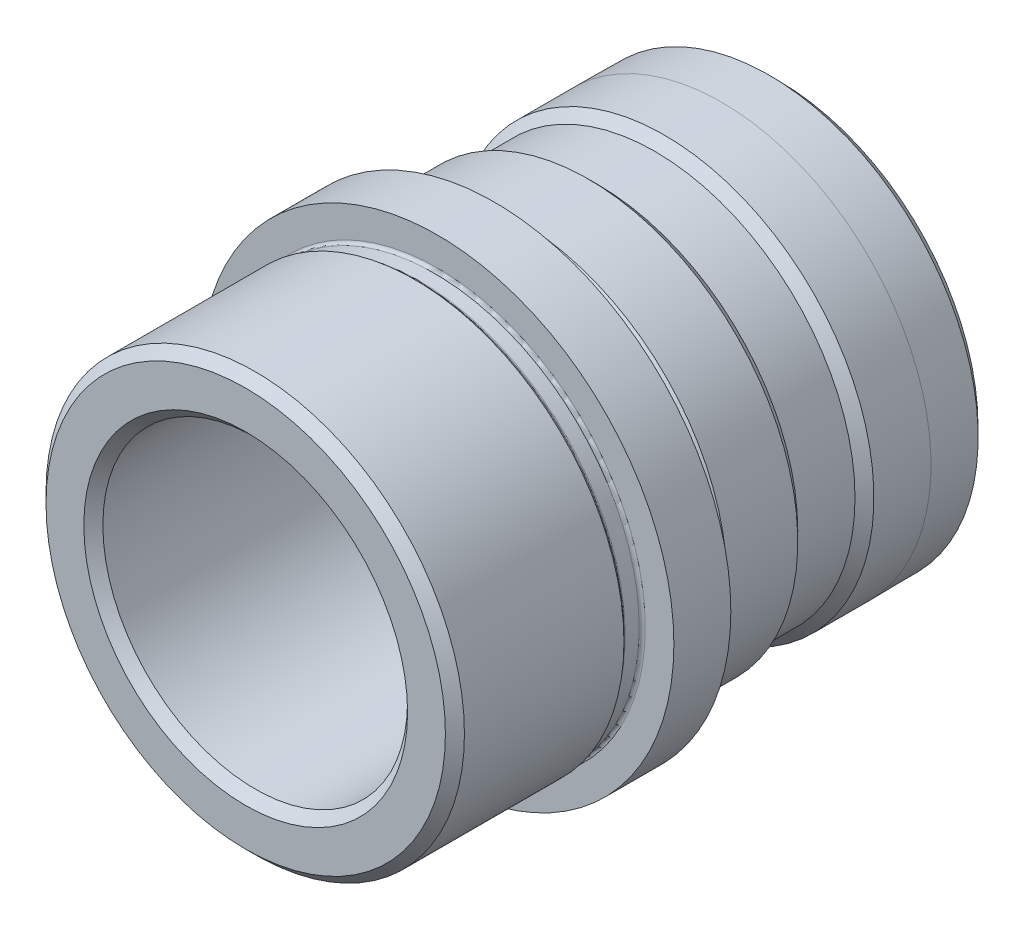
ISO-10303-21;
HEADER;
FILE_DESCRIPTION(('STEP AP214'),'2;1');
FILE_NAME('part.step','',(''),(''),'','','');
FILE_SCHEMA(('AUTOMOTIVE_DESIGN { 1 0 10303 214 1 1 1 1 }'));
ENDSEC;
DATA;
#1=APPLICATION_CONTEXT('core data for automotive mechanical design processes');
#2=APPLICATION_PROTOCOL_DEFINITION('international standard','automotive_design',2000,#1);
#3=PRODUCT_CONTEXT('',#1,'mechanical');
#4=PRODUCT('Part','Part','',(#3));
#5=PRODUCT_RELATED_PRODUCT_CATEGORY('part','',(#4));
#6=PRODUCT_DEFINITION_FORMATION('','',#4);
#7=PRODUCT_DEFINITION_CONTEXT('part definition',#1,'design');
#8=PRODUCT_DEFINITION('design','',#6,#7);
#9=PRODUCT_DEFINITION_SHAPE('','',#8);
#10=(LENGTH_UNIT() NAMED_UNIT(*) SI_UNIT(.MILLI.,.METRE.));
#11=(NAMED_UNIT(*) PLANE_ANGLE_UNIT() SI_UNIT($,.RADIAN.));
#12=(NAMED_UNIT(*) SI_UNIT($,.STERADIAN.) SOLID_ANGLE_UNIT());
#13=UNCERTAINTY_MEASURE_WITH_UNIT(LENGTH_MEASURE(1.E-05),#10,'distance_accuracy_value','');
#14=(GEOMETRIC_REPRESENTATION_CONTEXT(3) GLOBAL_UNCERTAINTY_ASSIGNED_CONTEXT((#13)) GLOBAL_UNIT_ASSIGNED_CONTEXT((#10,
#11,#12)) REPRESENTATION_CONTEXT('',''));
#15=CARTESIAN_POINT('',(0.,0.,0.));
#16=DIRECTION('',(0.,0.,1.));
#17=DIRECTION('',(1.,0.,0.));
#18=AXIS2_PLACEMENT_3D('',#15,#16,#17);
#19=CARTESIAN_POINT('',(0.,12.70762,16.002));
#20=DIRECTION('',(0.,0.,1.));
#21=DIRECTION('',(1.,0.,0.));
#22=AXIS2_PLACEMENT_3D('',#19,#20,#21);
#23=PLANE('',#22);
#24=CARTESIAN_POINT('',(0.,0.,16.002));
#25=DIRECTION('',(0.,0.,1.));
#26=DIRECTION('',(1.,0.,0.));
#27=AXIS2_PLACEMENT_3D('',#24,#25,#26);
#28=CIRCLE('',#27,16.65605);
#29=CARTESIAN_POINT('',(16.65605,0.,16.002));
#30=VERTEX_POINT('',#29);
#31=EDGE_CURVE('E66',#30,#30,#28,.T.);
#32=ORIENTED_EDGE('',*,*,#31,.T.);
#33=EDGE_LOOP('',(#32));
#34=FACE_BOUND('',#33,.T.);
#35=CARTESIAN_POINT('',(0.,0.,16.002));
#36=DIRECTION('',(0.,0.,1.));
#37=DIRECTION('',(1.,0.,0.));
#38=AXIS2_PLACEMENT_3D('',#35,#36,#37);
#39=CIRCLE('',#38,13.50137);
#40=CARTESIAN_POINT('',(13.50137,0.,16.002));
#41=VERTEX_POINT('',#40);
#42=EDGE_CURVE('E69',#41,#41,#39,.F.);
#43=ORIENTED_EDGE('',*,*,#42,.T.);
#44=EDGE_LOOP('',(#43));
#45=FACE_BOUND('',#44,.T.);
#46=ADVANCED_FACE('F31',(#34,#45),#23,.T.);
#47=CARTESIAN_POINT('',(0.,0.,0.));
#48=DIRECTION('',(0.,0.,-1.));
#49=DIRECTION('',(-1.,0.,0.));
#50=AXIS2_PLACEMENT_3D('',#47,#48,#49);
#51=CYLINDRICAL_SURFACE('',#50,17.4498);
#52=CARTESIAN_POINT('',(0.,0.,15.20825));
#53=DIRECTION('',(0.,0.,1.));
#54=DIRECTION('',(1.,0.,0.));
#55=AXIS2_PLACEMENT_3D('',#52,#53,#54);
#56=CIRCLE('',#55,17.4498);
#57=CARTESIAN_POINT('',(17.4498,0.,15.20825));
#58=VERTEX_POINT('',#57);
#59=EDGE_CURVE('E72',#58,#58,#56,.F.);
#60=ORIENTED_EDGE('',*,*,#59,.T.);
#61=EDGE_LOOP('',(#60));
#62=FACE_BOUND('',#61,.T.);
#63=CARTESIAN_POINT('',(0.,0.,1.905));
#64=DIRECTION('',(0.,0.,-1.));
#65=DIRECTION('',(-1.,0.,0.));
#66=AXIS2_PLACEMENT_3D('',#63,#64,#65);
#67=CIRCLE('',#66,17.4498);
#68=CARTESIAN_POINT('',(-17.4498,0.,1.905));
#69=VERTEX_POINT('',#68);
#70=EDGE_CURVE('E87',#69,#69,#67,.T.);
#71=ORIENTED_EDGE('',*,*,#70,.F.);
#72=EDGE_LOOP('',(#71));
#73=FACE_BOUND('',#72,.T.);
#74=ADVANCED_FACE('F156',(#62,#73),#51,.T.);
#75=CARTESIAN_POINT('',(0.,0.,1.524));
#76=DIRECTION('',(0.,0.,1.));
#77=DIRECTION('',(1.,0.,0.));
#78=AXIS2_PLACEMENT_3D('',#75,#76,#77);
#79=CONICAL_SURFACE('',#78,17.0688,0.785398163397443);
#80=CARTESIAN_POINT('',(0.,0.,1.59839487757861));
#81=DIRECTION('',(0.,0.,1.));
#82=DIRECTION('',(1.,0.,0.));
#83=AXIS2_PLACEMENT_3D('',#80,#81,#82);
#84=CIRCLE('',#83,17.1431948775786);
#85=CARTESIAN_POINT('',(17.1431948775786,0.,1.59839487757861));
#86=VERTEX_POINT('',#85);
#87=EDGE_CURVE('E38',#86,#86,#84,.T.);
#88=ORIENTED_EDGE('',*,*,#87,.T.);
#89=EDGE_LOOP('',(#88));
#90=FACE_BOUND('',#89,.T.);
#91=ORIENTED_EDGE('',*,*,#70,.T.);
#92=EDGE_LOOP('',(#91));
#93=FACE_BOUND('',#92,.T.);
#94=ADVANCED_FACE('F152',(#90,#93),#79,.T.);
#95=CARTESIAN_POINT('',(0.,0.,0.));
#96=DIRECTION('',(0.,0.,-1.));
#97=DIRECTION('',(-1.,0.,0.));
#98=AXIS2_PLACEMENT_3D('',#95,#96,#97);
#99=CYLINDRICAL_SURFACE('',#98,17.0688);
#100=CARTESIAN_POINT('',(0.,0.,1.41878975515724));
#101=DIRECTION('',(0.,0.,-1.));
#102=DIRECTION('',(-1.,0.,0.));
#103=AXIS2_PLACEMENT_3D('',#100,#101,#102);
#104=CIRCLE('',#103,17.0688);
#105=CARTESIAN_POINT('',(-17.0688,0.,1.41878975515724));
#106=VERTEX_POINT('',#105);
#107=EDGE_CURVE('E42',#106,#106,#104,.T.);
#108=ORIENTED_EDGE('',*,*,#107,.T.);
#109=EDGE_LOOP('',(#108));
#110=FACE_BOUND('',#109,.T.);
#111=CARTESIAN_POINT('',(0.,0.,0.254));
#112=DIRECTION('',(0.,0.,1.));
#113=DIRECTION('',(1.,0.,0.));
#114=AXIS2_PLACEMENT_3D('',#111,#112,#113);
#115=CIRCLE('',#114,17.0688);
#116=CARTESIAN_POINT('',(17.0688,0.,0.254));
#117=VERTEX_POINT('',#116);
#118=EDGE_CURVE('E46',#117,#117,#115,.T.);
#119=ORIENTED_EDGE('',*,*,#118,.T.);
#120=EDGE_LOOP('',(#119));
#121=FACE_BOUND('',#120,.T.);
#122=ADVANCED_FACE('F149',(#110,#121),#99,.T.);
#123=CARTESIAN_POINT('',(0.,19.7104,0.));
#124=DIRECTION('',(0.,0.,1.));
#125=DIRECTION('',(1.,0.,0.));
#126=AXIS2_PLACEMENT_3D('',#123,#124,#125);
#127=PLANE('',#126);
#128=CARTESIAN_POINT('',(0.,0.,0.));
#129=DIRECTION('',(0.,0.,1.));
#130=DIRECTION('',(1.,0.,0.));
#131=AXIS2_PLACEMENT_3D('',#128,#129,#130);
#132=CIRCLE('',#131,17.3228);
#133=CARTESIAN_POINT('',(17.3228,0.,0.));
#134=VERTEX_POINT('',#133);
#135=EDGE_CURVE('E10',#134,#134,#132,.F.);
#136=ORIENTED_EDGE('',*,*,#135,.T.);
#137=EDGE_LOOP('',(#136));
#138=FACE_BOUND('',#137,.T.);
#139=CARTESIAN_POINT('',(0.,0.,0.));
#140=DIRECTION('',(0.,0.,-1.));
#141=DIRECTION('',(-1.,0.,0.));
#142=AXIS2_PLACEMENT_3D('',#139,#140,#141);
#143=CIRCLE('',#142,19.7104);
#144=CARTESIAN_POINT('',(-19.7104,0.,0.));
#145=VERTEX_POINT('',#144);
#146=EDGE_CURVE('E386',#145,#145,#143,.T.);
#147=ORIENTED_EDGE('',*,*,#146,.F.);
#148=EDGE_LOOP('',(#147));
#149=FACE_BOUND('',#148,.T.);
#150=ADVANCED_FACE('F145',(#138,#149),#127,.T.);
#151=CARTESIAN_POINT('',(0.,0.,0.));
#152=DIRECTION('',(0.,0.,-1.));
#153=DIRECTION('',(-1.,0.,0.));
#154=AXIS2_PLACEMENT_3D('',#151,#152,#153);
#155=CYLINDRICAL_SURFACE('',#154,19.7104);
#156=ORIENTED_EDGE('',*,*,#146,.T.);
#157=EDGE_LOOP('',(#156));
#158=FACE_BOUND('',#157,.T.);
#159=CARTESIAN_POINT('',(0.,0.,-4.7498));
#160=DIRECTION('',(0.,0.,-1.));
#161=DIRECTION('',(-1.,0.,0.));
#162=AXIS2_PLACEMENT_3D('',#159,#160,#161);
#163=CIRCLE('',#162,19.7104);
#164=CARTESIAN_POINT('',(-19.7104,0.,-4.7498));
#165=VERTEX_POINT('',#164);
#166=EDGE_CURVE('E384',#165,#165,#163,.T.);
#167=ORIENTED_EDGE('',*,*,#166,.F.);
#168=EDGE_LOOP('',(#167));
#169=FACE_BOUND('',#168,.T.);
#170=ADVANCED_FACE('F141',(#158,#169),#155,.T.);
#171=CARTESIAN_POINT('',(0.,19.7104,-4.7498));
#172=DIRECTION('',(0.,0.,-1.));
#173=DIRECTION('',(-1.,0.,0.));
#174=AXIS2_PLACEMENT_3D('',#171,#172,#173);
#175=PLANE('',#174);
#176=CARTESIAN_POINT('',(0.,0.,-4.7498));
#177=DIRECTION('',(0.,0.,-1.));
#178=DIRECTION('',(-1.,0.,0.));
#179=AXIS2_PLACEMENT_3D('',#176,#177,#178);
#180=CIRCLE('',#179,17.3228);
#181=CARTESIAN_POINT('',(-17.3228,0.,-4.7498));
#182=VERTEX_POINT('',#181);
#183=EDGE_CURVE('E51',#182,#182,#180,.F.);
#184=ORIENTED_EDGE('',*,*,#183,.T.);
#185=EDGE_LOOP('',(#184));
#186=FACE_BOUND('',#185,.T.);
#187=ORIENTED_EDGE('',*,*,#166,.T.);
#188=EDGE_LOOP('',(#187));
#189=FACE_BOUND('',#188,.T.);
#190=ADVANCED_FACE('F137',(#186,#189),#175,.T.);
#191=CARTESIAN_POINT('',(0.,0.,0.));
#192=DIRECTION('',(0.,0.,-1.));
#193=DIRECTION('',(-1.,0.,0.));
#194=AXIS2_PLACEMENT_3D('',#191,#192,#193);
#195=CYLINDRICAL_SURFACE('',#194,17.0688);
#196=CARTESIAN_POINT('',(0.,0.,-6.16858975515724));
#197=DIRECTION('',(0.,0.,-1.));
#198=DIRECTION('',(-1.,0.,0.));
#199=AXIS2_PLACEMENT_3D('',#196,#197,#198);
#200=CIRCLE('',#199,17.0688);
#201=CARTESIAN_POINT('',(-17.0688,0.,-6.16858975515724));
#202=VERTEX_POINT('',#201);
#203=EDGE_CURVE('E54',#202,#202,#200,.F.);
#204=ORIENTED_EDGE('',*,*,#203,.T.);
#205=EDGE_LOOP('',(#204));
#206=FACE_BOUND('',#205,.T.);
#207=CARTESIAN_POINT('',(0.,0.,-5.0038));
#208=DIRECTION('',(0.,0.,-1.));
#209=DIRECTION('',(-1.,0.,0.));
#210=AXIS2_PLACEMENT_3D('',#207,#208,#209);
#211=CIRCLE('',#210,17.0688);
#212=CARTESIAN_POINT('',(-17.0688,0.,-5.0038));
#213=VERTEX_POINT('',#212);
#214=EDGE_CURVE('E57',#213,#213,#211,.T.);
#215=ORIENTED_EDGE('',*,*,#214,.T.);
#216=EDGE_LOOP('',(#215));
#217=FACE_BOUND('',#216,.T.);
#218=ADVANCED_FACE('F133',(#206,#217),#195,.T.);
#219=CARTESIAN_POINT('',(0.,0.,-6.67385));
#220=DIRECTION('',(0.,0.,-1.));
#221=DIRECTION('',(-1.,0.,0.));
#222=AXIS2_PLACEMENT_3D('',#219,#220,#221);
#223=CONICAL_SURFACE('',#222,17.46885,0.78539816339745);
#224=CARTESIAN_POINT('',(0.,0.,-6.34819487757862));
#225=DIRECTION('',(0.,0.,-1.));
#226=DIRECTION('',(-1.,0.,0.));
#227=AXIS2_PLACEMENT_3D('',#224,#225,#226);
#228=CIRCLE('',#227,17.1431948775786);
#229=CARTESIAN_POINT('',(-17.1431948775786,0.,-6.34819487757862));
#230=VERTEX_POINT('',#229);
#231=EDGE_CURVE('E60',#230,#230,#228,.T.);
#232=ORIENTED_EDGE('',*,*,#231,.T.);
#233=EDGE_LOOP('',(#232));
#234=FACE_BOUND('',#233,.T.);
#235=CARTESIAN_POINT('',(0.,0.,-6.67385));
#236=DIRECTION('',(0.,0.,-1.));
#237=DIRECTION('',(-1.,0.,0.));
#238=AXIS2_PLACEMENT_3D('',#235,#236,#237);
#239=CIRCLE('',#238,17.46885);
#240=CARTESIAN_POINT('',(-17.46885,0.,-6.67385));
#241=VERTEX_POINT('',#240);
#242=EDGE_CURVE('E381',#241,#241,#239,.T.);
#243=ORIENTED_EDGE('',*,*,#242,.F.);
#244=EDGE_LOOP('',(#243));
#245=FACE_BOUND('',#244,.T.);
#246=ADVANCED_FACE('F129',(#234,#245),#223,.T.);
#247=CARTESIAN_POINT('',(0.,0.,0.));
#248=DIRECTION('',(0.,0.,-1.));
#249=DIRECTION('',(-1.,0.,0.));
#250=AXIS2_PLACEMENT_3D('',#247,#248,#249);
#251=CYLINDRICAL_SURFACE('',#250,17.46885);
#252=ORIENTED_EDGE('',*,*,#242,.T.);
#253=EDGE_LOOP('',(#252));
#254=FACE_BOUND('',#253,.T.);
#255=CARTESIAN_POINT('',(0.,0.,-12.573));
#256=DIRECTION('',(0.,0.,-1.));
#257=DIRECTION('',(-1.,0.,0.));
#258=AXIS2_PLACEMENT_3D('',#255,#256,#257);
#259=CIRCLE('',#258,17.46885);
#260=CARTESIAN_POINT('',(-17.46885,0.,-12.573));
#261=VERTEX_POINT('',#260);
#262=EDGE_CURVE('E378',#261,#261,#259,.T.);
#263=ORIENTED_EDGE('',*,*,#262,.F.);
#264=EDGE_LOOP('',(#263));
#265=FACE_BOUND('',#264,.T.);
#266=ADVANCED_FACE('F125',(#254,#265),#251,.T.);
#267=CARTESIAN_POINT('',(0.,0.,-13.3604));
#268=DIRECTION('',(0.,0.,1.));
#269=DIRECTION('',(1.,0.,0.));
#270=AXIS2_PLACEMENT_3D('',#267,#268,#269);
#271=CONICAL_SURFACE('',#270,16.68145,0.785398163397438);
#272=ORIENTED_EDGE('',*,*,#262,.T.);
#273=EDGE_LOOP('',(#272));
#274=FACE_BOUND('',#273,.T.);
#275=CARTESIAN_POINT('',(0.,0.,-13.3604));
#276=DIRECTION('',(0.,0.,-1.));
#277=DIRECTION('',(-1.,0.,0.));
#278=AXIS2_PLACEMENT_3D('',#275,#276,#277);
#279=CIRCLE('',#278,16.68145);
#280=CARTESIAN_POINT('',(-16.68145,0.,-13.3604));
#281=VERTEX_POINT('',#280);
#282=EDGE_CURVE('E372',#281,#281,#279,.T.);
#283=ORIENTED_EDGE('',*,*,#282,.F.);
#284=EDGE_LOOP('',(#283));
#285=FACE_BOUND('',#284,.T.);
#286=ADVANCED_FACE('F120',(#274,#285),#271,.T.);
#287=CARTESIAN_POINT('',(0.,0.,0.));
#288=DIRECTION('',(0.,0.,-1.));
#289=DIRECTION('',(-1.,0.,0.));
#290=AXIS2_PLACEMENT_3D('',#287,#288,#289);
#291=CYLINDRICAL_SURFACE('',#290,16.68145);
#292=CARTESIAN_POINT('',(0.,-16.68145,-13.3731));
#293=CARTESIAN_POINT('',(-0.132679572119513,-16.6814479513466,-13.3731055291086));
#294=CARTESIAN_POINT('',(-0.265438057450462,-16.6798504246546,-13.3842562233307));
#295=CARTESIAN_POINT('',(-0.527249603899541,-16.6736312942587,-13.4285561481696));
#296=CARTESIAN_POINT('',(-0.656298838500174,-16.6690066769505,-13.4617273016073));
#297=CARTESIAN_POINT('',(-0.906864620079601,-16.6572534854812,-13.5490614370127));
#298=CARTESIAN_POINT('',(-1.02838658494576,-16.650126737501,-13.6032091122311));
#299=CARTESIAN_POINT('',(-1.26059924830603,-16.6341584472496,-13.7309230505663));
#300=CARTESIAN_POINT('',(-1.37129156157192,-16.6253171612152,-13.8044864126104));
#301=CARTESIAN_POINT('',(-1.57950500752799,-16.6068343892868,-13.9694979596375));
#302=CARTESIAN_POINT('',(-1.67693853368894,-16.5971882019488,-14.061056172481));
#303=CARTESIAN_POINT('',(-1.8551131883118,-16.5782199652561,-14.2592217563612));
#304=CARTESIAN_POINT('',(-1.93585339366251,-16.5688979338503,-14.3658299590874));
#305=CARTESIAN_POINT('',(-2.0786859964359,-16.551587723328,-14.5916519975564));
#306=CARTESIAN_POINT('',(-2.14069446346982,-16.5436056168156,-14.7109194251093));
#307=CARTESIAN_POINT('',(-2.24376716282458,-16.529942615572,-14.9583084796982));
#308=CARTESIAN_POINT('',(-2.28483242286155,-16.5242616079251,-15.0864296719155));
#309=CARTESIAN_POINT('',(-2.34458273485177,-16.5158898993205,-15.3469715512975));
#310=CARTESIAN_POINT('',(-2.36341716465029,-16.5131792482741,-15.4793573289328));
#311=CARTESIAN_POINT('',(-2.37863376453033,-16.5109944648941,-15.7454360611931));
#312=CARTESIAN_POINT('',(-2.37501709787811,-16.5115201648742,-15.8791289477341));
#313=CARTESIAN_POINT('',(-2.34555641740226,-16.5157304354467,-16.1429762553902));
#314=CARTESIAN_POINT('',(-2.31987817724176,-16.5193914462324,-16.2731496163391));
#315=CARTESIAN_POINT('',(-2.24728248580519,-16.5294230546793,-16.527320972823));
#316=CARTESIAN_POINT('',(-2.20036448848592,-16.5357937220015,-16.6513188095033));
#317=CARTESIAN_POINT('',(-2.08644683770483,-16.550553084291,-16.890127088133));
#318=CARTESIAN_POINT('',(-2.01937637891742,-16.558948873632,-17.0049032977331));
#319=CARTESIAN_POINT('',(-1.86710818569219,-16.576807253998,-17.2216347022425));
#320=CARTESIAN_POINT('',(-1.78190937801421,-16.5862699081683,-17.3235891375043));
#321=CARTESIAN_POINT('',(-1.59489016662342,-16.6053001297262,-17.5127441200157));
#322=CARTESIAN_POINT('',(-1.49292711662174,-16.6148678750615,-17.5998036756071));
#323=CARTESIAN_POINT('',(-1.27576155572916,-16.6329509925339,-17.7555956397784));
#324=CARTESIAN_POINT('',(-1.16055899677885,-16.6414663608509,-17.8243279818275));
#325=CARTESIAN_POINT('',(-0.920066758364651,-16.6564929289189,-17.9415193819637));
#326=CARTESIAN_POINT('',(-0.794772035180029,-16.6630031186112,-17.9899682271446));
#327=CARTESIAN_POINT('',(-0.537711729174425,-16.6732771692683,-18.0650982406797));
#328=CARTESIAN_POINT('',(-0.405946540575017,-16.6770411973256,-18.0917807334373));
#329=CARTESIAN_POINT('',(-0.140903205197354,-16.6813768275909,-18.1224346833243));
#330=CARTESIAN_POINT('',(-0.00764792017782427,-16.6819756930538,-18.1266000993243));
#331=CARTESIAN_POINT('',(0.257659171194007,-16.6799875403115,-18.1126155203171));
#332=CARTESIAN_POINT('',(0.389711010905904,-16.6774006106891,-18.0944661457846));
#333=CARTESIAN_POINT('',(0.648280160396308,-16.6693484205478,-18.0365284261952));
#334=CARTESIAN_POINT('',(0.774818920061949,-16.6638956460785,-17.9968339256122));
#335=CARTESIAN_POINT('',(1.01944471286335,-16.650721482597,-17.8970312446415));
#336=CARTESIAN_POINT('',(1.137531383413,-16.6429999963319,-17.8369221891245));
#337=CARTESIAN_POINT('',(1.36275818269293,-16.626079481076,-17.6975370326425));
#338=CARTESIAN_POINT('',(1.46982096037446,-16.6168710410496,-17.6181371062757));
#339=CARTESIAN_POINT('',(1.66917062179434,-16.5980326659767,-17.442597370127));
#340=CARTESIAN_POINT('',(1.76145673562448,-16.5884027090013,-17.3464566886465));
#341=CARTESIAN_POINT('',(1.92933348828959,-16.569720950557,-17.1393039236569));
#342=CARTESIAN_POINT('',(2.00479456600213,-16.5606739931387,-17.028186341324));
#343=CARTESIAN_POINT('',(2.13598041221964,-16.5442664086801,-16.7947392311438));
#344=CARTESIAN_POINT('',(2.19170567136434,-16.5369057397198,-16.6724099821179));
#345=CARTESIAN_POINT('',(2.28163431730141,-16.5247385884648,-16.4204085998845));
#346=CARTESIAN_POINT('',(2.31590745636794,-16.5199238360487,-16.2907617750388));
#347=CARTESIAN_POINT('',(2.36218189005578,-16.5133711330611,-16.0274791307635));
#348=CARTESIAN_POINT('',(2.37418455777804,-16.5116329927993,-15.8938435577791));
#349=CARTESIAN_POINT('',(2.37554708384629,-16.5114369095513,-15.6276673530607));
#350=CARTESIAN_POINT('',(2.36511058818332,-16.5129494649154,-15.4951277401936));
#351=CARTESIAN_POINT('',(2.32232577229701,-16.5190204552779,-15.2337083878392));
#352=CARTESIAN_POINT('',(2.28997747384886,-16.5235788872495,-15.104828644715));
#353=CARTESIAN_POINT('',(2.20435667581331,-16.5352180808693,-14.854434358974));
#354=CARTESIAN_POINT('',(2.1510969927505,-16.5422972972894,-14.7329153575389));
#355=CARTESIAN_POINT('',(2.0251853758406,-16.5581824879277,-14.5005052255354));
#356=CARTESIAN_POINT('',(1.95253291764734,-16.5669885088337,-14.3896143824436));
#357=CARTESIAN_POINT('',(1.78915291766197,-16.5854304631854,-14.1805714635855));
#358=CARTESIAN_POINT('',(1.6982741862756,-16.5950729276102,-14.0825381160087));
#359=CARTESIAN_POINT('',(1.50134035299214,-16.6140457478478,-13.9030392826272));
#360=CARTESIAN_POINT('',(1.39528171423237,-16.6233760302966,-13.8215776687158));
#361=CARTESIAN_POINT('',(1.17038666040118,-16.6407253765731,-13.6771799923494));
#362=CARTESIAN_POINT('',(1.05148975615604,-16.6487377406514,-13.6143373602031));
#363=CARTESIAN_POINT('',(0.804774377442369,-16.6624822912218,-13.5096055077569));
#364=CARTESIAN_POINT('',(0.676965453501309,-16.6682168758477,-13.4676942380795));
#365=CARTESIAN_POINT('',(0.457127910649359,-16.675426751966,-13.4156941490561));
#366=CARTESIAN_POINT('',(0.366466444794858,-16.6776740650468,-13.3997452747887));
#367=CARTESIAN_POINT('',(0.183882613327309,-16.6806863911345,-13.378446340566));
#368=CARTESIAN_POINT('',(0.0919602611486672,-16.6814514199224,-13.3730961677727));
#369=CARTESIAN_POINT('',(0.,-16.68145,-13.3731));
#370=B_SPLINE_CURVE_WITH_KNOTS('',3,(#292,#293,#294,#295,#296,#297,#298,#299,#300,#301,#302,
#303,#304,#305,#306,#307,#308,#309,#310,#311,#312,#313,#314,#315,#316,#317,#318,#319,#320,#321,
#322,#323,#324,#325,#326,#327,#328,#329,#330,#331,#332,#333,#334,#335,#336,#337,#338,#339,#340,
#341,#342,#343,#344,#345,#346,#347,#348,#349,#350,#351,#352,#353,#354,#355,#356,#357,#358,#359,
#360,#361,#362,#363,#364,#365,#366,#367,#368,#369),.UNSPECIFIED.,.T.,.F.,(4,2,2,2,2,2,2,2,2,2,2,
2,2,2,2,2,2,2,2,2,2,2,2,2,2,2,2,2,2,2,2,2,2,2,2,2,2,2,4),(0.,0.397702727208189,
0.795801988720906,1.19361129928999,1.59136120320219,1.9916233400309,2.39190760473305,
2.79395967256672,3.19599200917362,3.59530726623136,3.99460183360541,4.39092202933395,
4.78725241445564,5.18499191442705,5.58275496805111,5.98409665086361,6.3854397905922,
6.78698476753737,7.1885053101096,7.58656163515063,7.98460689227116,8.38093212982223,
8.7772743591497,9.17623117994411,9.575208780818,9.97716003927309,10.3791013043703,
10.7797287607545,11.1803315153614,11.5773139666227,11.9742960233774,12.3710351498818,
12.7677850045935,13.1679732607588,13.5682549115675,13.9705124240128,14.3723452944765,
14.6479961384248,14.9236440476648),.UNSPECIFIED.);
#371=CARTESIAN_POINT('',(0.,-16.68145,-13.3731));
#372=VERTEX_POINT('',#371);
#373=EDGE_CURVE('E95',#372,#372,#370,.T.);
#374=ORIENTED_EDGE('',*,*,#373,.F.);
#375=EDGE_LOOP('',(#374));
#376=FACE_BOUND('',#375,.T.);
#377=ORIENTED_EDGE('',*,*,#282,.T.);
#378=EDGE_LOOP('',(#377));
#379=FACE_BOUND('',#378,.T.);
#380=CARTESIAN_POINT('',(0.,0.,-18.1356));
#381=DIRECTION('',(0.,0.,-1.));
#382=DIRECTION('',(-1.,0.,0.));
#383=AXIS2_PLACEMENT_3D('',#380,#381,#382);
#384=CIRCLE('',#383,16.68145);
#385=CARTESIAN_POINT('',(-16.68145,0.,-18.1356));
#386=VERTEX_POINT('',#385);
#387=EDGE_CURVE('E368',#386,#386,#384,.T.);
#388=ORIENTED_EDGE('',*,*,#387,.F.);
#389=EDGE_LOOP('',(#388));
#390=FACE_BOUND('',#389,.T.);
#391=ADVANCED_FACE('F114',(#376,#379,#390),#291,.T.);
#392=CARTESIAN_POINT('',(0.,0.,-18.923));
#393=DIRECTION('',(0.,0.,-1.));
#394=DIRECTION('',(-1.,0.,0.));
#395=AXIS2_PLACEMENT_3D('',#392,#393,#394);
#396=CONICAL_SURFACE('',#395,17.46885,0.785398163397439);
#397=ORIENTED_EDGE('',*,*,#387,.T.);
#398=EDGE_LOOP('',(#397));
#399=FACE_BOUND('',#398,.T.);
#400=CARTESIAN_POINT('',(0.,0.,-18.923));
#401=DIRECTION('',(0.,0.,-1.));
#402=DIRECTION('',(-1.,0.,0.));
#403=AXIS2_PLACEMENT_3D('',#400,#401,#402);
#404=CIRCLE('',#403,17.46885);
#405=CARTESIAN_POINT('',(-17.46885,0.,-18.923));
#406=VERTEX_POINT('',#405);
#407=EDGE_CURVE('E371',#406,#406,#404,.T.);
#408=ORIENTED_EDGE('',*,*,#407,.F.);
#409=EDGE_LOOP('',(#408));
#410=FACE_BOUND('',#409,.T.);
#411=ADVANCED_FACE('F119',(#399,#410),#396,.T.);
#412=CARTESIAN_POINT('',(0.,0.,0.));
#413=DIRECTION('',(0.,0.,-1.));
#414=DIRECTION('',(-1.,0.,0.));
#415=AXIS2_PLACEMENT_3D('',#412,#413,#414);
#416=CYLINDRICAL_SURFACE('',#415,17.46885);
#417=ORIENTED_EDGE('',*,*,#407,.T.);
#418=EDGE_LOOP('',(#417));
#419=FACE_BOUND('',#418,.T.);
#420=CARTESIAN_POINT('',(0.,0.,-23.6855));
#421=DIRECTION('',(0.,0.,-1.));
#422=DIRECTION('',(-1.,0.,0.));
#423=AXIS2_PLACEMENT_3D('',#420,#421,#422);
#424=CIRCLE('',#423,17.46885);
#425=CARTESIAN_POINT('',(-17.46885,0.,-23.6855));
#426=VERTEX_POINT('',#425);
#427=EDGE_CURVE('E112',#426,#426,#424,.T.);
#428=ORIENTED_EDGE('',*,*,#427,.F.);
#429=EDGE_LOOP('',(#428));
#430=FACE_BOUND('',#429,.T.);
#431=ADVANCED_FACE('F301',(#419,#430),#416,.T.);
#432=CARTESIAN_POINT('',(0.,0.,-28.448));
#433=DIRECTION('',(0.,0.,1.));
#434=DIRECTION('',(1.,0.,0.));
#435=AXIS2_PLACEMENT_3D('',#432,#433,#434);
#436=CONICAL_SURFACE('',#435,17.4272882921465,0.00872664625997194);
#437=CARTESIAN_POINT('',(0.,0.,-27.654280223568));
#438=DIRECTION('',(0.,0.,-1.));
#439=DIRECTION('',(-1.,0.,0.));
#440=AXIS2_PLACEMENT_3D('',#437,#438,#439);
#441=CIRCLE('',#440,17.4342149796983);
#442=CARTESIAN_POINT('',(-17.4342149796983,0.,-27.654280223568));
#443=VERTEX_POINT('',#442);
#444=EDGE_CURVE('E75',#443,#443,#441,.F.);
#445=ORIENTED_EDGE('',*,*,#444,.T.);
#446=EDGE_LOOP('',(#445));
#447=FACE_BOUND('',#446,.T.);
#448=ORIENTED_EDGE('',*,*,#427,.T.);
#449=EDGE_LOOP('',(#448));
#450=FACE_BOUND('',#449,.T.);
#451=ADVANCED_FACE('F292',(#447,#450),#436,.T.);
#452=CARTESIAN_POINT('',(0.,17.4272882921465,-28.448));
#453=DIRECTION('',(0.,0.,-1.));
#454=DIRECTION('',(-1.,0.,0.));
#455=AXIS2_PLACEMENT_3D('',#452,#453,#454);
#456=PLANE('',#455);
#457=CARTESIAN_POINT('',(0.,0.,-28.448));
#458=DIRECTION('',(0.,0.,-1.));
#459=DIRECTION('',(-1.,0.,0.));
#460=AXIS2_PLACEMENT_3D('',#457,#458,#459);
#461=CIRCLE('',#460,16.6265198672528);
#462=CARTESIAN_POINT('',(-16.6265198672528,0.,-28.448));
#463=VERTEX_POINT('',#462);
#464=EDGE_CURVE('E78',#463,#463,#461,.T.);
#465=ORIENTED_EDGE('',*,*,#464,.T.);
#466=EDGE_LOOP('',(#465));
#467=FACE_BOUND('',#466,.T.);
#468=CARTESIAN_POINT('',(0.,0.,-28.448));
#469=DIRECTION('',(0.,0.,-1.));
#470=DIRECTION('',(-1.,0.,0.));
#471=AXIS2_PLACEMENT_3D('',#468,#469,#470);
#472=CIRCLE('',#471,15.75562);
#473=CARTESIAN_POINT('',(-15.75562,0.,-28.448));
#474=VERTEX_POINT('',#473);
#475=EDGE_CURVE('E81',#474,#474,#472,.F.);
#476=ORIENTED_EDGE('',*,*,#475,.T.);
#477=EDGE_LOOP('',(#476));
#478=FACE_BOUND('',#477,.T.);
#479=ADVANCED_FACE('F282',(#467,#478),#456,.T.);
#480=CARTESIAN_POINT('',(0.,0.,0.));
#481=DIRECTION('',(0.,0.,-1.));
#482=DIRECTION('',(-1.,0.,0.));
#483=AXIS2_PLACEMENT_3D('',#480,#481,#482);
#484=CYLINDRICAL_SURFACE('',#483,12.70762);
#485=CARTESIAN_POINT('',(0.,0.,15.20825));
#486=DIRECTION('',(0.,0.,1.));
#487=DIRECTION('',(1.,0.,0.));
#488=AXIS2_PLACEMENT_3D('',#485,#486,#487);
#489=CIRCLE('',#488,12.70762);
#490=CARTESIAN_POINT('',(12.70762,0.,15.20825));
#491=VERTEX_POINT('',#490);
#492=EDGE_CURVE('E63',#491,#491,#489,.T.);
#493=ORIENTED_EDGE('',*,*,#492,.T.);
#494=EDGE_LOOP('',(#493));
#495=FACE_BOUND('',#494,.T.);
#496=CARTESIAN_POINT('',(0.,0.,-25.4));
#497=DIRECTION('',(0.,0.,-1.));
#498=DIRECTION('',(-1.,0.,0.));
#499=AXIS2_PLACEMENT_3D('',#496,#497,#498);
#500=CIRCLE('',#499,12.70762);
#501=CARTESIAN_POINT('',(-12.70762,0.,-25.4));
#502=VERTEX_POINT('',#501);
#503=EDGE_CURVE('E84',#502,#502,#500,.T.);
#504=ORIENTED_EDGE('',*,*,#503,.T.);
#505=EDGE_LOOP('',(#504));
#506=FACE_BOUND('',#505,.T.);
#507=CARTESIAN_POINT('',(0.,-12.70762,-13.3731));
#508=CARTESIAN_POINT('',(0.132166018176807,-12.7076176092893,-13.3731050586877));
#509=CARTESIAN_POINT('',(0.264397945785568,-12.7055368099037,-13.3841700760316));
#510=CARTESIAN_POINT('',(0.525136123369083,-12.6974366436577,-13.4281096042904));
#511=CARTESIAN_POINT('',(0.653639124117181,-12.6914139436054,-13.4610025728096));
#512=CARTESIAN_POINT('',(0.903110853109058,-12.6761037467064,-13.5475561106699));
#513=CARTESIAN_POINT('',(1.0240862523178,-12.666819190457,-13.601197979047));
#514=CARTESIAN_POINT('',(1.25530869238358,-12.6459993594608,-13.72767366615));
#515=CARTESIAN_POINT('',(1.36555661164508,-12.6344642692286,-13.8005059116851));
#516=CARTESIAN_POINT('',(1.57351789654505,-12.610263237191,-13.9642150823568));
#517=CARTESIAN_POINT('',(1.67108512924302,-12.5975865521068,-14.0552760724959));
#518=CARTESIAN_POINT('',(1.84965133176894,-12.5726108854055,-14.2524618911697));
#519=CARTESIAN_POINT('',(1.93064911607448,-12.5603119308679,-14.35858779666));
#520=CARTESIAN_POINT('',(2.07438431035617,-12.5373798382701,-14.5839227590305));
#521=CARTESIAN_POINT('',(2.13697319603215,-12.5267605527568,-14.7032280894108));
#522=CARTESIAN_POINT('',(2.24116316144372,-12.5085414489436,-14.9508918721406));
#523=CARTESIAN_POINT('',(2.28276603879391,-12.5009413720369,-15.0792495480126));
#524=CARTESIAN_POINT('',(2.34333430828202,-12.4897292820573,-15.339811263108));
#525=CARTESIAN_POINT('',(2.36255447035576,-12.4860724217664,-15.4719541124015));
#526=CARTESIAN_POINT('',(2.37860248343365,-12.4830255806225,-15.7376357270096));
#527=CARTESIAN_POINT('',(2.37543232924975,-12.4836352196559,-15.8711743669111));
#528=CARTESIAN_POINT('',(2.34699631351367,-12.4890116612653,-16.134011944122));
#529=CARTESIAN_POINT('',(2.32202004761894,-12.493723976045,-16.2633434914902));
#530=CARTESIAN_POINT('',(2.25113681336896,-12.5066892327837,-16.5159477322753));
#531=CARTESIAN_POINT('',(2.20522896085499,-12.5149423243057,-16.6392201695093));
#532=CARTESIAN_POINT('',(2.09350217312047,-12.5341162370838,-16.8770548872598));
#533=CARTESIAN_POINT('',(2.0275662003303,-12.5450526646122,-16.9915608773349));
#534=CARTESIAN_POINT('',(1.8777376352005,-12.5683506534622,-17.2079927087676));
#535=CARTESIAN_POINT('',(1.79384323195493,-12.580712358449,-17.3099172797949));
#536=CARTESIAN_POINT('',(1.60891737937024,-12.60570552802,-17.4999663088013));
#537=CARTESIAN_POINT('',(1.50763820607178,-12.6183381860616,-17.5878497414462));
#538=CARTESIAN_POINT('',(1.29164696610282,-12.6422719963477,-17.74541524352));
#539=CARTESIAN_POINT('',(1.17693476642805,-12.6535731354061,-17.8150971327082));
#540=CARTESIAN_POINT('',(0.93708307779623,-12.6735931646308,-17.9343166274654));
#541=CARTESIAN_POINT('',(0.811930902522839,-12.682308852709,-17.9838292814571));
#542=CARTESIAN_POINT('',(0.554886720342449,-12.6961511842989,-18.061061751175));
#543=CARTESIAN_POINT('',(0.4229954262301,-12.7012782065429,-18.0887838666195));
#544=CARTESIAN_POINT('',(0.158290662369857,-12.7073135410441,-18.121313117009));
#545=CARTESIAN_POINT('',(0.0255191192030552,-12.7082826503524,-18.1264505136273));
#546=CARTESIAN_POINT('',(-0.238985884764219,-12.706060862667,-18.1145502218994));
#547=CARTESIAN_POINT('',(-0.370719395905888,-12.7028701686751,-18.0975136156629));
#548=CARTESIAN_POINT('',(-0.62836221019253,-12.6927251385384,-18.0420235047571));
#549=CARTESIAN_POINT('',(-0.754308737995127,-12.6858001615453,-18.0037370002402));
#550=CARTESIAN_POINT('',(-0.997995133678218,-12.6689598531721,-17.9070145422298));
#551=CARTESIAN_POINT('',(-1.11573444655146,-12.6590443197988,-17.8485772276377));
#552=CARTESIAN_POINT('',(-1.34107447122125,-12.6371711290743,-17.7124802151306));
#553=CARTESIAN_POINT('',(-1.44855113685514,-12.6251924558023,-17.6346185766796));
#554=CARTESIAN_POINT('',(-1.64903158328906,-12.6005762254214,-17.4621565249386));
#555=CARTESIAN_POINT('',(-1.74203402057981,-12.5879386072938,-17.3675545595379));
#556=CARTESIAN_POINT('',(-1.91217999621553,-12.5632272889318,-17.1628025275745));
#557=CARTESIAN_POINT('',(-1.9890982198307,-12.5511632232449,-17.05246387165));
#558=CARTESIAN_POINT('',(-2.12330852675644,-12.5291584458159,-16.8202377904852));
#559=CARTESIAN_POINT('',(-2.18060133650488,-12.5192176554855,-16.698350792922));
#560=CARTESIAN_POINT('',(-2.27361450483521,-12.5026604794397,-16.4470617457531));
#561=CARTESIAN_POINT('',(-2.30943840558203,-12.4960281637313,-16.3176991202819));
#562=CARTESIAN_POINT('',(-2.35881636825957,-12.4868023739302,-16.0546554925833));
#563=CARTESIAN_POINT('',(-2.37237292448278,-12.4842084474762,-15.9209749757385));
#564=CARTESIAN_POINT('',(-2.37674834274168,-12.4833759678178,-15.6553469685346));
#565=CARTESIAN_POINT('',(-2.36792259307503,-12.4850693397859,-15.5234054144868));
#566=CARTESIAN_POINT('',(-2.32856170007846,-12.4924697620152,-15.2629218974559));
#567=CARTESIAN_POINT('',(-2.29802668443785,-12.4981767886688,-15.1343799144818));
#568=CARTESIAN_POINT('',(-2.21626356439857,-12.5129329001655,-14.8845338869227));
#569=CARTESIAN_POINT('',(-2.16507370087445,-12.5219758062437,-14.7632169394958));
#570=CARTESIAN_POINT('',(-2.04349277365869,-12.542389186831,-14.5308365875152));
#571=CARTESIAN_POINT('',(-1.97310036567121,-12.5537598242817,-14.4197739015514));
#572=CARTESIAN_POINT('',(-1.81387598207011,-12.5777589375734,-14.2092740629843));
#573=CARTESIAN_POINT('',(-1.72478527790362,-12.5904036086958,-14.1100344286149));
#574=CARTESIAN_POINT('',(-1.53123294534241,-12.6154046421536,-13.9277947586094));
#575=CARTESIAN_POINT('',(-1.42676779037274,-12.6277609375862,-13.8447984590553));
#576=CARTESIAN_POINT('',(-1.20431385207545,-12.6509224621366,-13.6967090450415));
#577=CARTESIAN_POINT('',(-1.08621256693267,-12.6617128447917,-13.6317825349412));
#578=CARTESIAN_POINT('',(-0.840614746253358,-12.6803817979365,-13.5227964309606));
#579=CARTESIAN_POINT('',(-0.713127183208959,-12.6882631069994,-13.4787172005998));
#580=CARTESIAN_POINT('',(-0.487717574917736,-12.6986156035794,-13.4216459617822));
#581=CARTESIAN_POINT('',(-0.391114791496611,-12.7019732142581,-13.4034722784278));
#582=CARTESIAN_POINT('',(-0.196353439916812,-12.7064762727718,-13.3791975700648));
#583=CARTESIAN_POINT('',(-0.0981949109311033,-12.7076217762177,-13.373096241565));
#584=CARTESIAN_POINT('',(0.,-12.70762,-13.3731));
#585=B_SPLINE_CURVE_WITH_KNOTS('',3,(#507,#508,#509,#510,#511,#512,#513,#514,#515,#516,#517,
#518,#519,#520,#521,#522,#523,#524,#525,#526,#527,#528,#529,#530,#531,#532,#533,#534,#535,#536,
#537,#538,#539,#540,#541,#542,#543,#544,#545,#546,#547,#548,#549,#550,#551,#552,#553,#554,#555,
#556,#557,#558,#559,#560,#561,#562,#563,#564,#565,#566,#567,#568,#569,#570,#571,#572,#573,#574,
#575,#576,#577,#578,#579,#580,#581,#582,#583,#584),.UNSPECIFIED.,.T.,.F.,(4,2,2,2,2,2,2,2,2,2,2,
2,2,2,2,2,2,2,2,2,2,2,2,2,2,2,2,2,2,2,2,2,2,2,2,2,2,2,4),(0.,0.396138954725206,
0.792613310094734,1.18873115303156,1.58481653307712,1.98512382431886,2.38545974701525,
2.78894218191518,3.19239004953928,3.59119936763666,3.98997315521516,4.3835302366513,
4.77710394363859,5.17302331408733,5.56898262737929,5.97114080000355,6.37330295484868,
6.77596112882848,7.1785768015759,7.57528491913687,7.97197367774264,8.36558817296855,
8.75922926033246,9.15714698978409,9.55510163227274,9.95830433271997,10.361492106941,
10.7627193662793,11.1639016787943,11.5587539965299,11.9536039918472,12.3477262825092,
12.7418761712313,13.1418894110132,13.5419945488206,13.9456749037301,14.3489742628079,
14.6432995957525,14.9376175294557),.UNSPECIFIED.);
#586=CARTESIAN_POINT('',(0.,-12.70762,-13.3731));
#587=VERTEX_POINT('',#586);
#588=EDGE_CURVE('E88',#587,#587,#585,.T.);
#589=ORIENTED_EDGE('',*,*,#588,.F.);
#590=EDGE_LOOP('',(#589));
#591=FACE_BOUND('',#590,.T.);
#592=ADVANCED_FACE('F97',(#495,#506,#591),#484,.F.);
#593=CARTESIAN_POINT('',(0.,-19.7104,-15.748));
#594=DIRECTION('',(0.,1.,0.));
#595=DIRECTION('',(0.,0.,1.));
#596=AXIS2_PLACEMENT_3D('',#593,#594,#595);
#597=CYLINDRICAL_SURFACE('',#596,2.3749);
#598=ORIENTED_EDGE('',*,*,#373,.T.);
#599=EDGE_LOOP('',(#598));
#600=FACE_BOUND('',#599,.T.);
#601=ORIENTED_EDGE('',*,*,#588,.T.);
#602=EDGE_LOOP('',(#601));
#603=FACE_BOUND('',#602,.T.);
#604=ADVANCED_FACE('F100',(#600,#603),#597,.F.);
#605=CARTESIAN_POINT('',(0.,0.,-25.4));
#606=DIRECTION('',(0.,0.,-1.));
#607=DIRECTION('',(-1.,0.,0.));
#608=AXIS2_PLACEMENT_3D('',#605,#606,#607);
#609=TOROIDAL_SURFACE('',#608,15.75562,3.048);
#610=ORIENTED_EDGE('',*,*,#475,.F.);
#611=EDGE_LOOP('',(#610));
#612=FACE_BOUND('',#611,.T.);
#613=ORIENTED_EDGE('',*,*,#503,.F.);
#614=EDGE_LOOP('',(#613));
#615=FACE_BOUND('',#614,.T.);
#616=ADVANCED_FACE('F103',(#612,#615),#609,.T.);
#617=CARTESIAN_POINT('',(0.,0.,-28.448));
#618=DIRECTION('',(0.,0.,1.));
#619=DIRECTION('',(1.,0.,0.));
#620=AXIS2_PLACEMENT_3D('',#617,#618,#619);
#621=CONICAL_SURFACE('',#620,16.6265198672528,0.794124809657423);
#622=ORIENTED_EDGE('',*,*,#444,.F.);
#623=EDGE_LOOP('',(#622));
#624=FACE_BOUND('',#623,.T.);
#625=ORIENTED_EDGE('',*,*,#464,.F.);
#626=EDGE_LOOP('',(#625));
#627=FACE_BOUND('',#626,.T.);
#628=ADVANCED_FACE('F165',(#624,#627),#621,.T.);
#629=CARTESIAN_POINT('',(0.,0.,15.20825));
#630=DIRECTION('',(0.,0.,-1.));
#631=DIRECTION('',(-1.,0.,0.));
#632=AXIS2_PLACEMENT_3D('',#629,#630,#631);
#633=CONICAL_SURFACE('',#632,17.4498,0.78539816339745);
#634=ORIENTED_EDGE('',*,*,#31,.F.);
#635=EDGE_LOOP('',(#634));
#636=FACE_BOUND('',#635,.T.);
#637=ORIENTED_EDGE('',*,*,#59,.F.);
#638=EDGE_LOOP('',(#637));
#639=FACE_BOUND('',#638,.T.);
#640=ADVANCED_FACE('F169',(#636,#639),#633,.T.);
#641=CARTESIAN_POINT('',(0.,0.,16.002));
#642=DIRECTION('',(0.,0.,1.));
#643=DIRECTION('',(1.,0.,0.));
#644=AXIS2_PLACEMENT_3D('',#641,#642,#643);
#645=CONICAL_SURFACE('',#644,13.50137,0.785398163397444);
#646=ORIENTED_EDGE('',*,*,#492,.F.);
#647=EDGE_LOOP('',(#646));
#648=FACE_BOUND('',#647,.T.);
#649=ORIENTED_EDGE('',*,*,#42,.F.);
#650=EDGE_LOOP('',(#649));
#651=FACE_BOUND('',#650,.T.);
#652=ADVANCED_FACE('F173',(#648,#651),#645,.F.);
#653=CARTESIAN_POINT('',(0.,0.,-6.16858975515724));
#654=DIRECTION('',(0.,0.,-1.));
#655=DIRECTION('',(-1.,0.,0.));
#656=AXIS2_PLACEMENT_3D('',#653,#654,#655);
#657=TOROIDAL_SURFACE('',#656,17.3228,0.254);
#658=ORIENTED_EDGE('',*,*,#203,.F.);
#659=EDGE_LOOP('',(#658));
#660=FACE_BOUND('',#659,.T.);
#661=ORIENTED_EDGE('',*,*,#231,.F.);
#662=EDGE_LOOP('',(#661));
#663=FACE_BOUND('',#662,.T.);
#664=ADVANCED_FACE('F177',(#660,#663),#657,.F.);
#665=CARTESIAN_POINT('',(0.,0.,-5.0038));
#666=DIRECTION('',(0.,0.,-1.));
#667=DIRECTION('',(-1.,0.,0.));
#668=AXIS2_PLACEMENT_3D('',#665,#666,#667);
#669=TOROIDAL_SURFACE('',#668,17.3228,0.254);
#670=ORIENTED_EDGE('',*,*,#183,.F.);
#671=EDGE_LOOP('',(#670));
#672=FACE_BOUND('',#671,.T.);
#673=ORIENTED_EDGE('',*,*,#214,.F.);
#674=EDGE_LOOP('',(#673));
#675=FACE_BOUND('',#674,.T.);
#676=ADVANCED_FACE('F181',(#672,#675),#669,.F.);
#677=CARTESIAN_POINT('',(0.,0.,1.41878975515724));
#678=DIRECTION('',(0.,0.,-1.));
#679=DIRECTION('',(-1.,0.,0.));
#680=AXIS2_PLACEMENT_3D('',#677,#678,#679);
#681=TOROIDAL_SURFACE('',#680,17.3228,0.254);
#682=ORIENTED_EDGE('',*,*,#87,.F.);
#683=EDGE_LOOP('',(#682));
#684=FACE_BOUND('',#683,.T.);
#685=ORIENTED_EDGE('',*,*,#107,.F.);
#686=EDGE_LOOP('',(#685));
#687=FACE_BOUND('',#686,.T.);
#688=ADVANCED_FACE('F184',(#684,#687),#681,.F.);
#689=CARTESIAN_POINT('',(0.,0.,0.254));
#690=DIRECTION('',(0.,0.,1.));
#691=DIRECTION('',(1.,0.,0.));
#692=AXIS2_PLACEMENT_3D('',#689,#690,#691);
#693=TOROIDAL_SURFACE('',#692,17.3228,0.254);
#694=ORIENTED_EDGE('',*,*,#118,.F.);
#695=EDGE_LOOP('',(#694));
#696=FACE_BOUND('',#695,.T.);
#697=ORIENTED_EDGE('',*,*,#135,.F.);
#698=EDGE_LOOP('',(#697));
#699=FACE_BOUND('',#698,.T.);
#700=ADVANCED_FACE('F33',(#696,#699),#693,.F.);
#701=CLOSED_SHELL('',(#46,#74,#94,#122,#150,#170,#190,#218,#246,#266,#286,#391,#411,#431,#451,
#479,#592,#604,#616,#628,#640,#652,#664,#676,#688,#700));
#702=MANIFOLD_SOLID_BREP('B2',#701);
#703=ADVANCED_BREP_SHAPE_REPRESENTATION('',(#18,#702),#14);
#704=SHAPE_DEFINITION_REPRESENTATION(#9,#703);
ENDSEC;
END-ISO-10303-21;
